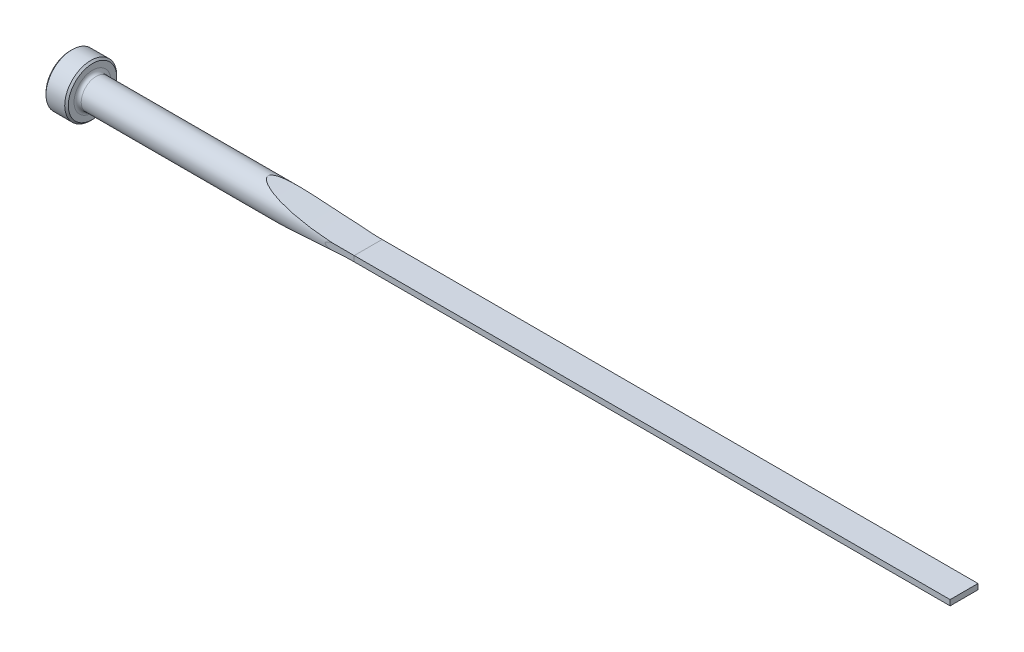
ISO-10303-21;
HEADER;
FILE_DESCRIPTION(('STEP AP214'),'2;1');
FILE_NAME('part.step','',(''),(''),'','','');
FILE_SCHEMA(('AUTOMOTIVE_DESIGN { 1 0 10303 214 1 1 1 1 }'));
ENDSEC;
DATA;
#1=APPLICATION_CONTEXT('core data for automotive mechanical design processes');
#2=APPLICATION_PROTOCOL_DEFINITION('international standard','automotive_design',2000,#1);
#3=PRODUCT_CONTEXT('',#1,'mechanical');
#4=PRODUCT('Part','Part','',(#3));
#5=PRODUCT_RELATED_PRODUCT_CATEGORY('part','',(#4));
#6=PRODUCT_DEFINITION_FORMATION('','',#4);
#7=PRODUCT_DEFINITION_CONTEXT('part definition',#1,'design');
#8=PRODUCT_DEFINITION('design','',#6,#7);
#9=PRODUCT_DEFINITION_SHAPE('','',#8);
#10=(LENGTH_UNIT() NAMED_UNIT(*) SI_UNIT(.MILLI.,.METRE.));
#11=(NAMED_UNIT(*) PLANE_ANGLE_UNIT() SI_UNIT($,.RADIAN.));
#12=(NAMED_UNIT(*) SI_UNIT($,.STERADIAN.) SOLID_ANGLE_UNIT());
#13=UNCERTAINTY_MEASURE_WITH_UNIT(LENGTH_MEASURE(1.E-05),#10,'distance_accuracy_value','');
#14=(GEOMETRIC_REPRESENTATION_CONTEXT(3) GLOBAL_UNCERTAINTY_ASSIGNED_CONTEXT((#13)) GLOBAL_UNIT_ASSIGNED_CONTEXT((#10,
#11,#12)) REPRESENTATION_CONTEXT('',''));
#15=CARTESIAN_POINT('',(0.,0.,0.));
#16=DIRECTION('',(0.,0.,1.));
#17=DIRECTION('',(1.,0.,0.));
#18=AXIS2_PLACEMENT_3D('',#15,#16,#17);
#19=CARTESIAN_POINT('',(0.,0.,0.));
#20=DIRECTION('',(-1.,0.,0.));
#21=DIRECTION('',(0.,0.,1.));
#22=AXIS2_PLACEMENT_3D('',#19,#20,#21);
#23=CYLINDRICAL_SURFACE('',#22,3.175);
#24=CARTESIAN_POINT('',(5.5118,0.,0.));
#25=DIRECTION('',(-1.,0.,0.));
#26=DIRECTION('',(0.,0.,1.));
#27=AXIS2_PLACEMENT_3D('',#24,#25,#26);
#28=CIRCLE('',#27,3.175);
#29=CARTESIAN_POINT('',(5.5118,0.,3.175));
#30=VERTEX_POINT('',#29);
#31=EDGE_CURVE('E153',#30,#30,#28,.F.);
#32=ORIENTED_EDGE('',*,*,#31,.T.);
#33=EDGE_LOOP('',(#32));
#34=FACE_BOUND('',#33,.T.);
#35=CARTESIAN_POINT('',(63.5,1.11760000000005,2.97179999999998));
#36=CARTESIAN_POINT('',(63.2357957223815,1.11753103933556,2.9717988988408));
#37=CARTESIAN_POINT('',(62.9715815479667,1.11446404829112,2.97297778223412));
#38=CARTESIAN_POINT('',(62.443191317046,1.10185346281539,2.97768913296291));
#39=CARTESIAN_POINT('',(62.1790153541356,1.09230645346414,2.98122284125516));
#40=CARTESIAN_POINT('',(61.6493837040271,1.06617269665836,2.9906669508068));
#41=CARTESIAN_POINT('',(61.3839303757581,1.04954219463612,2.99659211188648));
#42=CARTESIAN_POINT('',(60.8537877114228,1.00807205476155,3.01079697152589));
#43=CARTESIAN_POINT('',(60.5890982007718,0.983234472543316,3.01907608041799));
#44=CARTESIAN_POINT('',(60.0615789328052,0.92338352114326,3.03792875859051));
#45=CARTESIAN_POINT('',(59.7987461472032,0.888396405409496,3.04849639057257));
#46=CARTESIAN_POINT('',(59.4064659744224,0.825064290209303,3.06600005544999));
#47=CARTESIAN_POINT('',(59.2761087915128,0.802161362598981,3.07210597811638));
#48=CARTESIAN_POINT('',(59.0163554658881,0.751700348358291,3.08484243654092));
#49=CARTESIAN_POINT('',(58.8869590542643,0.724143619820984,3.09147281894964));
#50=CARTESIAN_POINT('',(58.6294078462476,0.662714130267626,3.10522998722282));
#51=CARTESIAN_POINT('',(58.5012554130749,0.628831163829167,3.11235756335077));
#52=CARTESIAN_POINT('',(58.3111286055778,0.570760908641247,3.12333709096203));
#53=CARTESIAN_POINT('',(58.2480498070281,0.550175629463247,3.12704828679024));
#54=CARTESIAN_POINT('',(58.1230456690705,0.505797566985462,3.13453462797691));
#55=CARTESIAN_POINT('',(58.061119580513,0.482006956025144,3.13830972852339));
#56=CARTESIAN_POINT('',(57.9388265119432,0.42976946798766,3.1458898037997));
#57=CARTESIAN_POINT('',(57.8784713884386,0.401294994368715,3.14969481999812));
#58=CARTESIAN_POINT('',(57.761395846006,0.337410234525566,3.1571914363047));
#59=CARTESIAN_POINT('',(57.7046630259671,0.302025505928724,3.16088339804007));
#60=CARTESIAN_POINT('',(57.6318457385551,0.243613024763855,3.16568281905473));
#61=CARTESIAN_POINT('',(57.6116878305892,0.225790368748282,3.16701915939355));
#62=CARTESIAN_POINT('',(57.5741240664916,0.187442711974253,3.16952077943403));
#63=CARTESIAN_POINT('',(57.5567070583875,0.166929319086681,3.17068675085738));
#64=CARTESIAN_POINT('',(57.5335834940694,0.132884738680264,3.17224001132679));
#65=CARTESIAN_POINT('',(57.5261886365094,0.120518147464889,3.17273788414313));
#66=CARTESIAN_POINT('',(57.5132601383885,0.0948283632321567,3.1736095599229));
#67=CARTESIAN_POINT('',(57.5077252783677,0.0815058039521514,3.17398344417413));
#68=CARTESIAN_POINT('',(57.4990082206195,0.053897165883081,3.1745727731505));
#69=CARTESIAN_POINT('',(57.4958567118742,0.0396010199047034,3.17478615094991));
#70=CARTESIAN_POINT('',(57.4924789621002,0.0106696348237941,3.17501485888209));
#71=CARTESIAN_POINT('',(57.4922487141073,-0.00396511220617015,3.17503046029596));
#72=CARTESIAN_POINT('',(57.4945596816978,-0.0309283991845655,3.17487397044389));
#73=CARTESIAN_POINT('',(57.4967167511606,-0.0432925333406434,3.17472789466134));
#74=CARTESIAN_POINT('',(57.5029656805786,-0.0675187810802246,3.17430516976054));
#75=CARTESIAN_POINT('',(57.5070594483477,-0.0793803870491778,3.17402839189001));
#76=CARTESIAN_POINT('',(57.5191372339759,-0.107852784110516,3.17321302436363));
#77=CARTESIAN_POINT('',(57.5280454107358,-0.124065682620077,3.17261252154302));
#78=CARTESIAN_POINT('',(57.5482326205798,-0.154926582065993,3.17125564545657));
#79=CARTESIAN_POINT('',(57.5595181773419,-0.169570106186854,3.1704988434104));
#80=CARTESIAN_POINT('',(57.5944341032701,-0.209900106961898,3.16816531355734));
#81=CARTESIAN_POINT('',(57.6200991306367,-0.233790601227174,3.16645919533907));
#82=CARTESIAN_POINT('',(57.6742928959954,-0.277993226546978,3.1628833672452));
#83=CARTESIAN_POINT('',(57.702830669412,-0.298293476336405,3.16101314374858));
#84=CARTESIAN_POINT('',(57.7823413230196,-0.349789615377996,3.155843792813));
#85=CARTESIAN_POINT('',(57.8348887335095,-0.37851929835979,3.15247078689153));
#86=CARTESIAN_POINT('',(57.9423072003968,-0.431320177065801,3.14567655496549));
#87=CARTESIAN_POINT('',(57.9971839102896,-0.455379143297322,3.14225522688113));
#88=CARTESIAN_POINT('',(58.1085705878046,-0.500302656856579,3.13541729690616));
#89=CARTESIAN_POINT('',(58.165087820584,-0.521149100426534,3.13200082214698));
#90=CARTESIAN_POINT('',(58.2788979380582,-0.560302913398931,3.12523191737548));
#91=CARTESIAN_POINT('',(58.3361896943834,-0.578613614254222,3.12187940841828));
#92=CARTESIAN_POINT('',(58.5297297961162,-0.636913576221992,3.1107447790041));
#93=CARTESIAN_POINT('',(58.6673130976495,-0.672489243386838,3.10314401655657));
#94=CARTESIAN_POINT('',(58.9441302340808,-0.736755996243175,3.0885058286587));
#95=CARTESIAN_POINT('',(59.0833651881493,-0.765442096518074,3.08146881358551));
#96=CARTESIAN_POINT('',(59.3631295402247,-0.817784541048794,3.06799404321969));
#97=CARTESIAN_POINT('',(59.5036611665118,-0.841429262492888,3.06155769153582));
#98=CARTESIAN_POINT('',(59.7853732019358,-0.884713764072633,3.04932851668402));
#99=CARTESIAN_POINT('',(59.9265536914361,-0.904353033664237,3.04353577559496));
#100=CARTESIAN_POINT('',(60.3506897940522,-0.95834898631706,3.02714982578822));
#101=CARTESIAN_POINT('',(60.6343099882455,-0.987796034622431,3.01754551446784));
#102=CARTESIAN_POINT('',(61.202086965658,-1.03680456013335,3.00105004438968));
#103=CARTESIAN_POINT('',(61.4862426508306,-1.05637822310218,2.99415554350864));
#104=CARTESIAN_POINT('',(61.9149168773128,-1.079629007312,2.98581493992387));
#105=CARTESIAN_POINT('',(62.059256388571,-1.08638681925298,2.98335806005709));
#106=CARTESIAN_POINT('',(62.3480641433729,-1.0978849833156,2.97914616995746));
#107=CARTESIAN_POINT('',(62.4925324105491,-1.1026248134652,2.97739134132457));
#108=CARTESIAN_POINT('',(62.780840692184,-1.1101534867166,2.97459254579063));
#109=CARTESIAN_POINT('',(62.9246804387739,-1.11295147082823,2.97354524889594));
#110=CARTESIAN_POINT('',(63.2123469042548,-1.11667170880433,2.97214903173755));
#111=CARTESIAN_POINT('',(63.3561736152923,-1.11759449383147,2.97179991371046));
#112=CARTESIAN_POINT('',(63.5,-1.11760000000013,2.97179999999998));
#113=B_SPLINE_CURVE_WITH_KNOTS('',3,(#35,#36,#37,#38,#39,#40,#41,#42,#43,#44,#45,#46,#47,#48,
#49,#50,#51,#52,#53,#54,#55,#56,#57,#58,#59,#60,#61,#62,#63,#64,#65,#66,#67,#68,#69,#70,#71,#72,
#73,#74,#75,#76,#77,#78,#79,#80,#81,#82,#83,#84,#85,#86,#87,#88,#89,#90,#91,#92,#93,#94,#95,#96,
#97,#98,#99,#100,#101,#102,#103,#104,#105,#106,#107,#108,#109,#110,#111,#112),.UNSPECIFIED.,.F.,
.F.,(4,2,2,2,2,2,2,2,2,2,2,2,2,2,2,2,2,2,2,2,2,2,2,2,2,2,2,2,2,2,2,2,2,2,2,2,2,2,4),(0.,
0.792608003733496,1.58563403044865,2.38363126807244,3.18142878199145,3.97718078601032,
4.37459807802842,4.77189959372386,5.16984765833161,5.36916585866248,5.56834964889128,
5.7687520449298,5.96842682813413,6.04909120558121,6.12941838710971,6.17255460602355,
6.21566248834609,6.25931641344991,6.30291045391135,6.34039079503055,6.37790813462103,
6.43311579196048,6.48847696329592,6.59320183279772,6.69826703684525,6.87774508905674,
7.05768691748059,7.23860836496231,7.41928981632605,7.84588397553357,8.2727859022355,
8.70066164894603,9.12859189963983,9.98423938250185,10.8388282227,11.2723701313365,
11.7060241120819,12.1376226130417,12.569098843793),.UNSPECIFIED.);
#114=CARTESIAN_POINT('',(58.8183920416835,0.707555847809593,3.09515584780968));
#115=VERTEX_POINT('',#114);
#116=CARTESIAN_POINT('',(58.8183920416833,-0.707555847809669,3.09515584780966));
#117=VERTEX_POINT('',#116);
#118=EDGE_CURVE('E156',#115,#117,#113,.T.);
#119=ORIENTED_EDGE('',*,*,#118,.F.);
#120=CARTESIAN_POINT('',(63.5,0.584199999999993,3.12079082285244));
#121=CARTESIAN_POINT('',(63.2371745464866,0.584199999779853,3.12078868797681));
#122=CARTESIAN_POINT('',(62.9743505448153,0.585365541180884,3.1205729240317));
#123=CARTESIAN_POINT('',(62.4487238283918,0.590027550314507,3.11969558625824));
#124=CARTESIAN_POINT('',(62.1859211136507,0.593524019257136,3.11903401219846));
#125=CARTESIAN_POINT('',(61.3972884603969,0.607514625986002,3.11635178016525));
#126=CARTESIAN_POINT('',(60.8715185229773,0.621509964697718,3.11363357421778));
#127=CARTESIAN_POINT('',(59.8126378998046,0.659101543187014,3.10589488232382));
#128=CARTESIAN_POINT('',(59.2795323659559,0.682835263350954,3.10084129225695));
#129=CARTESIAN_POINT('',(58.2141584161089,0.739880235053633,3.08772725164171));
#130=CARTESIAN_POINT('',(57.6818897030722,0.773186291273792,3.07966843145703));
#131=CARTESIAN_POINT('',(56.6145881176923,0.849617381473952,3.05946899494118));
#132=CARTESIAN_POINT('',(56.0795602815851,0.892805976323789,3.04730170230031));
#133=CARTESIAN_POINT('',(55.0105273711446,0.98885062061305,3.01750402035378));
#134=CARTESIAN_POINT('',(54.4765222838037,1.04170654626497,2.99987370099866));
#135=CARTESIAN_POINT('',(53.4083814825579,1.15720203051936,2.95724818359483));
#136=CARTESIAN_POINT('',(52.8742493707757,1.21986783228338,2.93223306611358));
#137=CARTESIAN_POINT('',(51.8078537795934,1.35479225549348,2.8723879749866));
#138=CARTESIAN_POINT('',(51.275589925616,1.42704882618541,2.83756009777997));
#139=CARTESIAN_POINT('',(50.2195468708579,1.58015660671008,2.75522233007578));
#140=CARTESIAN_POINT('',(49.6957406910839,1.66089887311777,2.70786361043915));
#141=CARTESIAN_POINT('',(48.9123277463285,1.78881840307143,2.62361042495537));
#142=CARTESIAN_POINT('',(48.6514552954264,1.83261396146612,2.59330680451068));
#143=CARTESIAN_POINT('',(48.130757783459,1.92241510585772,2.52746039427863));
#144=CARTESIAN_POINT('',(47.8709326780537,1.96842059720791,2.49191782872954));
#145=CARTESIAN_POINT('',(47.3538754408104,2.06234142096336,2.41475697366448));
#146=CARTESIAN_POINT('',(47.0966368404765,2.11024620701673,2.37316953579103));
#147=CARTESIAN_POINT('',(46.583893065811,2.20806672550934,2.28243713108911));
#148=CARTESIAN_POINT('',(46.3283877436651,2.25798228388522,2.23329281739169));
#149=CARTESIAN_POINT('',(45.8200571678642,2.3595957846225,2.12566034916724));
#150=CARTESIAN_POINT('',(45.5672286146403,2.41129108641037,2.06718560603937));
#151=CARTESIAN_POINT('',(45.1906253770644,2.48998603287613,1.97035684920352));
#152=CARTESIAN_POINT('',(45.0655521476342,2.5164050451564,1.93656774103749));
#153=CARTESIAN_POINT('',(44.8164899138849,2.56957146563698,1.86545052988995));
#154=CARTESIAN_POINT('',(44.6925008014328,2.59631884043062,1.82812278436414));
#155=CARTESIAN_POINT('',(44.5043779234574,2.63731895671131,1.76799333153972));
#156=CARTESIAN_POINT('',(44.4397421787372,2.65148196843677,1.74669729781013));
#157=CARTESIAN_POINT('',(44.3109121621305,2.67986105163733,1.70283623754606));
#158=CARTESIAN_POINT('',(44.2467179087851,2.69407712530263,1.68027115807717));
#159=CARTESIAN_POINT('',(44.054818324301,2.73679613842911,1.61045418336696));
#160=CARTESIAN_POINT('',(43.9278729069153,2.76535313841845,1.56110473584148));
#161=CARTESIAN_POINT('',(43.6766959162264,2.82242510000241,1.45538898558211));
#162=CARTESIAN_POINT('',(43.5524682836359,2.85093995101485,1.39901319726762));
#163=CARTESIAN_POINT('',(43.3083876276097,2.90750331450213,1.27733339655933));
#164=CARTESIAN_POINT('',(43.1885301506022,2.93555228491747,1.21203881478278));
#165=CARTESIAN_POINT('',(43.0134198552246,2.97689561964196,1.10462346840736));
#166=CARTESIAN_POINT('',(42.9555167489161,2.99063021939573,1.06700049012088));
#167=CARTESIAN_POINT('',(42.8421800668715,3.01762925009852,0.988070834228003));
#168=CARTESIAN_POINT('',(42.7867451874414,3.03089392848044,0.946766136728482));
#169=CARTESIAN_POINT('',(42.6795671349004,3.05664308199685,0.859997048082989));
#170=CARTESIAN_POINT('',(42.6278038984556,3.06913174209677,0.814558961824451));
#171=CARTESIAN_POINT('',(42.5291143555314,3.09302846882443,0.718503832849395));
#172=CARTESIAN_POINT('',(42.4821794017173,3.10443846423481,0.66789638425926));
#173=CARTESIAN_POINT('',(42.4062402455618,3.12295621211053,0.573975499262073));
#174=CARTESIAN_POINT('',(42.3756865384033,3.13042646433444,0.532000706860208));
#175=CARTESIAN_POINT('',(42.319989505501,3.14407041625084,0.444313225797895));
#176=CARTESIAN_POINT('',(42.2948479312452,3.15024369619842,0.398599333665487));
#177=CARTESIAN_POINT('',(42.2515870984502,3.16088069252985,0.302976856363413));
#178=CARTESIAN_POINT('',(42.2335600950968,3.16532194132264,0.253022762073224));
#179=CARTESIAN_POINT('',(42.2071060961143,3.1718436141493,0.150502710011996));
#180=CARTESIAN_POINT('',(42.1986583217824,3.17392914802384,0.09794266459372));
#181=CARTESIAN_POINT('',(42.1928749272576,3.17535672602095,-0.0025704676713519));
#182=CARTESIAN_POINT('',(42.1945169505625,3.17495118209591,-0.050461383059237));
#183=CARTESIAN_POINT('',(42.206329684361,3.17203608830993,-0.145121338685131));
#184=CARTESIAN_POINT('',(42.2165083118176,3.16952458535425,-0.191889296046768));
#185=CARTESIAN_POINT('',(42.2467484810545,3.16207319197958,-0.291266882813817));
#186=CARTESIAN_POINT('',(42.2682680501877,3.15677538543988,-0.343396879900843));
#187=CARTESIAN_POINT('',(42.319104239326,3.1442883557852,-0.44342951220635));
#188=CARTESIAN_POINT('',(42.3484358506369,3.13709549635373,-0.491323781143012));
#189=CARTESIAN_POINT('',(42.4341809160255,3.11612565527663,-0.613534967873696));
#190=CARTESIAN_POINT('',(42.4955856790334,3.10116282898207,-0.68409687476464));
#191=CARTESIAN_POINT('',(42.6274278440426,3.06921055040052,-0.81556719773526));
#192=CARTESIAN_POINT('',(42.6978914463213,3.05221523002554,-0.876446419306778));
#193=CARTESIAN_POINT('',(42.8740641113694,3.0099730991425,-1.01378453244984));
#194=CARTESIAN_POINT('',(42.9824809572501,2.98417432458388,-1.08655383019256));
#195=CARTESIAN_POINT('',(43.2056195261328,2.93154913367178,-1.22141406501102));
#196=CARTESIAN_POINT('',(43.3203543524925,2.9047206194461,-1.28348161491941));
#197=CARTESIAN_POINT('',(43.5543659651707,2.8505103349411,-1.39976579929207));
#198=CARTESIAN_POINT('',(43.6736638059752,2.82312636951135,-1.45393855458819));
#199=CARTESIAN_POINT('',(43.9148065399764,2.76831054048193,-1.55576795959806));
#200=CARTESIAN_POINT('',(44.0366486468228,2.74087875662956,-1.60343134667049));
#201=CARTESIAN_POINT('',(44.2724756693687,2.6883146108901,-1.68995257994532));
#202=CARTESIAN_POINT('',(44.3863134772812,2.66317312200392,-1.72920940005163));
#203=CARTESIAN_POINT('',(44.6152532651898,2.61308810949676,-1.80399982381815));
#204=CARTESIAN_POINT('',(44.7303553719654,2.5881446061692,-1.83953305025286));
#205=CARTESIAN_POINT('',(45.07725239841,2.51369761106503,-1.94140787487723));
#206=CARTESIAN_POINT('',(45.3105347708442,2.46460067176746,-2.00298800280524));
#207=CARTESIAN_POINT('',(45.7801839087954,2.36775045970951,-2.11658508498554));
#208=CARTESIAN_POINT('',(46.016556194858,2.32000027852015,-2.16858134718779));
#209=CARTESIAN_POINT('',(46.4912089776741,2.2261369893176,-2.26482997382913));
#210=CARTESIAN_POINT('',(46.7294896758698,2.18002405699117,-2.30908150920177));
#211=CARTESIAN_POINT('',(47.2077596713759,2.08950783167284,-2.39130118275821));
#212=CARTESIAN_POINT('',(47.4477507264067,2.04510673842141,-2.42926143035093));
#213=CARTESIAN_POINT('',(47.9288506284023,1.95815199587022,-2.49987840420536));
#214=CARTESIAN_POINT('',(48.1699595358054,1.91559844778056,-2.5325348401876));
#215=CARTESIAN_POINT('',(48.8939707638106,1.79090778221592,-2.62372500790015));
#216=CARTESIAN_POINT('',(49.3782070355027,1.71161765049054,-2.67558617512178));
#217=CARTESIAN_POINT('',(50.4017474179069,1.5527357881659,-2.77111730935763));
#218=CARTESIAN_POINT('',(50.9413255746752,1.47404484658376,-2.81328790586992));
#219=CARTESIAN_POINT('',(52.0226566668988,1.32650947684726,-2.88578179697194));
#220=CARTESIAN_POINT('',(52.5644098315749,1.25766611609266,-2.91610380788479));
#221=CARTESIAN_POINT('',(53.6499230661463,1.12988542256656,-2.96795071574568));
#222=CARTESIAN_POINT('',(54.1936843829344,1.07095595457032,-2.98946864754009));
#223=CARTESIAN_POINT('',(55.2823907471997,0.963128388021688,-3.02592833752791));
#224=CARTESIAN_POINT('',(55.8273357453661,0.91422987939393,-3.0408703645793));
#225=CARTESIAN_POINT('',(56.9170263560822,0.826585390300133,-3.06585234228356));
#226=CARTESIAN_POINT('',(57.4617700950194,0.787818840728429,-3.07590226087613));
#227=CARTESIAN_POINT('',(58.5519411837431,0.720327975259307,-3.09240327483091));
#228=CARTESIAN_POINT('',(59.0973685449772,0.691603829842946,-3.09885430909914));
#229=CARTESIAN_POINT('',(60.1884833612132,0.644220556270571,-3.10904978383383));
#230=CARTESIAN_POINT('',(60.7341706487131,0.625557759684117,-3.11279521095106));
#231=CARTESIAN_POINT('',(61.8257926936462,0.598289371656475,-3.11815160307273));
#232=CARTESIAN_POINT('',(62.3717274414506,0.5896834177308,-3.11976264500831));
#233=CARTESIAN_POINT('',(63.0147373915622,0.585471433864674,-3.12055240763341));
#234=CARTESIAN_POINT('',(63.1117904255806,0.58499464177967,-3.12064189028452));
#235=CARTESIAN_POINT('',(63.3058955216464,0.584358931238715,-3.12076117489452));
#236=CARTESIAN_POINT('',(63.402947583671,0.584200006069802,-3.12079097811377));
#237=CARTESIAN_POINT('',(63.5,0.584199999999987,-3.12079082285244));
#238=B_SPLINE_CURVE_WITH_KNOTS('',3,(#120,#121,#122,#123,#124,#125,#126,#127,#128,#129,#130,
#131,#132,#133,#134,#135,#136,#137,#138,#139,#140,#141,#142,#143,#144,#145,#146,#147,#148,#149,
#150,#151,#152,#153,#154,#155,#156,#157,#158,#159,#160,#161,#162,#163,#164,#165,#166,#167,#168,
#169,#170,#171,#172,#173,#174,#175,#176,#177,#178,#179,#180,#181,#182,#183,#184,#185,#186,#187,
#188,#189,#190,#191,#192,#193,#194,#195,#196,#197,#198,#199,#200,#201,#202,#203,#204,#205,#206,
#207,#208,#209,#210,#211,#212,#213,#214,#215,#216,#217,#218,#219,#220,#221,#222,#223,#224,#225,
#226,#227,#228,#229,#230,#231,#232,#233,#234,#235,#236,#237),.UNSPECIFIED.,.F.,.F.,(4,2,2,2,2,2,
2,2,2,2,2,2,2,2,2,2,2,2,2,2,2,2,2,2,2,2,2,2,2,2,2,2,2,2,2,2,2,2,2,2,2,2,2,2,2,2,2,2,2,2,2,2,2,2,
2,2,2,2,4),(0.,0.788470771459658,1.5769419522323,3.15473771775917,4.75561916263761,
6.35563337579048,7.96624289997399,9.57683180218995,11.1918053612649,12.8064341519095,
14.4024082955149,15.2011185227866,15.9997945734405,16.7945288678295,17.5891945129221,
18.3827280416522,18.7793586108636,19.1759491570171,19.38447279,19.5930051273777,
20.0103161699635,20.4281968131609,20.8456389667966,21.056749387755,21.267746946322,
21.4774848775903,21.686840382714,21.8438665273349,22.0009434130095,22.1599950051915,
22.3187009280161,22.4616100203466,22.6046517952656,22.7736460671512,22.942967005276,
23.2255463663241,23.5089622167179,23.9072760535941,24.3064496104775,24.7077634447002,
25.108658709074,25.4776243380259,25.8466273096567,26.5849685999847,27.3248857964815,
28.064882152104,28.8057997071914,29.5467577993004,31.0266670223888,32.6671542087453,
34.3078190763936,35.9497794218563,37.5916726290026,39.2302062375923,40.8687676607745,
42.5067312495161,44.1446357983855,44.4357983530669,44.7269547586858),.UNSPECIFIED.);
#239=CARTESIAN_POINT('',(58.8183920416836,0.707555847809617,-3.09515584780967));
#240=VERTEX_POINT('',#239);
#241=EDGE_CURVE('E106',#115,#240,#238,.T.);
#242=ORIENTED_EDGE('',*,*,#241,.T.);
#243=CARTESIAN_POINT('',(63.5,1.11760000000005,-2.97179999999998));
#244=CARTESIAN_POINT('',(63.2357957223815,1.11753103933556,-2.9717988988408));
#245=CARTESIAN_POINT('',(62.9715815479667,1.11446404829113,-2.97297778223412));
#246=CARTESIAN_POINT('',(62.443191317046,1.10185346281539,-2.97768913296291));
#247=CARTESIAN_POINT('',(62.1790153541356,1.09230645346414,-2.98122284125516));
#248=CARTESIAN_POINT('',(61.6493837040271,1.06617269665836,-2.9906669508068));
#249=CARTESIAN_POINT('',(61.383930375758,1.04954219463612,-2.99659211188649));
#250=CARTESIAN_POINT('',(60.8537877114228,1.00807205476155,-3.01079697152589));
#251=CARTESIAN_POINT('',(60.5890982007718,0.983234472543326,-3.01907608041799));
#252=CARTESIAN_POINT('',(60.0615789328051,0.923383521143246,-3.03792875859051));
#253=CARTESIAN_POINT('',(59.7987461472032,0.888396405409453,-3.04849639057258));
#254=CARTESIAN_POINT('',(59.4064659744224,0.825064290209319,-3.06600005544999));
#255=CARTESIAN_POINT('',(59.2761087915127,0.802161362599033,-3.07210597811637));
#256=CARTESIAN_POINT('',(59.016355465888,0.751700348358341,-3.08484243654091));
#257=CARTESIAN_POINT('',(58.8869590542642,0.724143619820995,-3.09147281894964));
#258=CARTESIAN_POINT('',(58.6294078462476,0.662714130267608,-3.10522998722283));
#259=CARTESIAN_POINT('',(58.5012554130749,0.628831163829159,-3.11235756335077));
#260=CARTESIAN_POINT('',(58.3111286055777,0.57076090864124,-3.12333709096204));
#261=CARTESIAN_POINT('',(58.2480498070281,0.550175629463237,-3.12704828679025));
#262=CARTESIAN_POINT('',(58.1230456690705,0.505797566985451,-3.13453462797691));
#263=CARTESIAN_POINT('',(58.061119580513,0.482006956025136,-3.13830972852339));
#264=CARTESIAN_POINT('',(57.9388265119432,0.429769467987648,-3.14588980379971));
#265=CARTESIAN_POINT('',(57.8784713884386,0.401294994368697,-3.14969481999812));
#266=CARTESIAN_POINT('',(57.761395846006,0.337410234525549,-3.1571914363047));
#267=CARTESIAN_POINT('',(57.7046630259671,0.302025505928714,-3.16088339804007));
#268=CARTESIAN_POINT('',(57.6318457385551,0.243613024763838,-3.16568281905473));
#269=CARTESIAN_POINT('',(57.6116878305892,0.225790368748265,-3.16701915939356));
#270=CARTESIAN_POINT('',(57.5741240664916,0.187442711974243,-3.16952077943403));
#271=CARTESIAN_POINT('',(57.5567070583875,0.166929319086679,-3.17068675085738));
#272=CARTESIAN_POINT('',(57.5335834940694,0.132884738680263,-3.17224001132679));
#273=CARTESIAN_POINT('',(57.5261886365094,0.120518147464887,-3.17273788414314));
#274=CARTESIAN_POINT('',(57.5132601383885,0.0948283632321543,-3.1736095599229));
#275=CARTESIAN_POINT('',(57.5077252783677,0.0815058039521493,-3.17398344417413));
#276=CARTESIAN_POINT('',(57.4990082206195,0.0538971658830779,-3.1745727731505));
#277=CARTESIAN_POINT('',(57.4958567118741,0.0396010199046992,-3.17478615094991));
#278=CARTESIAN_POINT('',(57.4924789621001,0.0106696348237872,-3.17501485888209));
#279=CARTESIAN_POINT('',(57.4922487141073,-0.00396511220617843,-3.17503046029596));
#280=CARTESIAN_POINT('',(57.4945596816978,-0.0309283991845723,-3.17487397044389));
#281=CARTESIAN_POINT('',(57.4967167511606,-0.0432925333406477,-3.17472789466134));
#282=CARTESIAN_POINT('',(57.5029656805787,-0.0675187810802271,-3.17430516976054));
#283=CARTESIAN_POINT('',(57.5070594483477,-0.0793803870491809,-3.17402839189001));
#284=CARTESIAN_POINT('',(57.5191372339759,-0.107852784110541,-3.17321302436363));
#285=CARTESIAN_POINT('',(57.5280454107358,-0.124065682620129,-3.17261252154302));
#286=CARTESIAN_POINT('',(57.5482326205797,-0.154926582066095,-3.17125564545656));
#287=CARTESIAN_POINT('',(57.5595181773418,-0.16957010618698,-3.17049884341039));
#288=CARTESIAN_POINT('',(57.59443410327,-0.209900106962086,-3.16816531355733));
#289=CARTESIAN_POINT('',(57.6200991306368,-0.233790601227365,-3.16645919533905));
#290=CARTESIAN_POINT('',(57.6742928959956,-0.277993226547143,-3.16288336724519));
#291=CARTESIAN_POINT('',(57.7028306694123,-0.298293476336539,-3.16101314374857));
#292=CARTESIAN_POINT('',(57.7823413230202,-0.349789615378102,-3.15584379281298));
#293=CARTESIAN_POINT('',(57.8348887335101,-0.378519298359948,-3.15247078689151));
#294=CARTESIAN_POINT('',(57.9423072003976,-0.431320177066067,-3.14567655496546));
#295=CARTESIAN_POINT('',(57.9971839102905,-0.455379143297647,-3.14225522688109));
#296=CARTESIAN_POINT('',(58.1085705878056,-0.500302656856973,-3.13541729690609));
#297=CARTESIAN_POINT('',(58.1650878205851,-0.52114910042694,-3.13200082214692));
#298=CARTESIAN_POINT('',(58.2788979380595,-0.56030291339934,-3.12523191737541));
#299=CARTESIAN_POINT('',(58.3361896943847,-0.578613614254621,-3.12187940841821));
#300=CARTESIAN_POINT('',(58.5297297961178,-0.636913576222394,-3.11074477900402));
#301=CARTESIAN_POINT('',(58.6673130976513,-0.672489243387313,-3.10314401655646));
#302=CARTESIAN_POINT('',(58.9441302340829,-0.736755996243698,-3.08850582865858));
#303=CARTESIAN_POINT('',(59.0833651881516,-0.76544209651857,-3.08146881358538));
#304=CARTESIAN_POINT('',(59.3631295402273,-0.81778454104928,-3.06799404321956));
#305=CARTESIAN_POINT('',(59.5036611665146,-0.84142926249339,-3.06155769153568));
#306=CARTESIAN_POINT('',(59.7853732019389,-0.884713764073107,-3.04932851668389));
#307=CARTESIAN_POINT('',(59.9265536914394,-0.904353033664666,-3.04353577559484));
#308=CARTESIAN_POINT('',(60.3506897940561,-0.95834898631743,-3.0271498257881));
#309=CARTESIAN_POINT('',(60.6343099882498,-0.987796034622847,-3.0175455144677));
#310=CARTESIAN_POINT('',(61.2020869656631,-1.0368045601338,-3.00105004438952));
#311=CARTESIAN_POINT('',(61.4862426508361,-1.05637822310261,-2.99415554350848));
#312=CARTESIAN_POINT('',(61.9149168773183,-1.0796290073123,-2.98581493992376));
#313=CARTESIAN_POINT('',(62.059256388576,-1.0863868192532,-2.98335806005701));
#314=CARTESIAN_POINT('',(62.348064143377,-1.09788498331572,-2.97914616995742));
#315=CARTESIAN_POINT('',(62.4925324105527,-1.10262481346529,-2.97739134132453));
#316=CARTESIAN_POINT('',(62.7808406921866,-1.11015348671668,-2.9745925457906));
#317=CARTESIAN_POINT('',(62.924680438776,-1.11295147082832,-2.97354524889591));
#318=CARTESIAN_POINT('',(63.2123469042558,-1.11667170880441,-2.97214903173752));
#319=CARTESIAN_POINT('',(63.3561736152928,-1.11759449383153,-2.97179991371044));
#320=CARTESIAN_POINT('',(63.5,-1.11760000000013,-2.97179999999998));
#321=B_SPLINE_CURVE_WITH_KNOTS('',3,(#243,#244,#245,#246,#247,#248,#249,#250,#251,#252,#253,
#254,#255,#256,#257,#258,#259,#260,#261,#262,#263,#264,#265,#266,#267,#268,#269,#270,#271,#272,
#273,#274,#275,#276,#277,#278,#279,#280,#281,#282,#283,#284,#285,#286,#287,#288,#289,#290,#291,
#292,#293,#294,#295,#296,#297,#298,#299,#300,#301,#302,#303,#304,#305,#306,#307,#308,#309,#310,
#311,#312,#313,#314,#315,#316,#317,#318,#319,#320),.UNSPECIFIED.,.F.,.F.,(4,2,2,2,2,2,2,2,2,2,2,
2,2,2,2,2,2,2,2,2,2,2,2,2,2,2,2,2,2,2,2,2,2,2,2,2,2,2,4),(0.,0.792608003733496,1.58563403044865,
2.38363126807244,3.18142878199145,3.97718078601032,4.37459807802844,4.77189959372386,
5.16984765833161,5.36916585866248,5.56834964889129,5.7687520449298,5.96842682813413,
6.04909120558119,6.12941838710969,6.17255460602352,6.21566248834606,6.25931641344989,
6.30291045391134,6.34039079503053,6.37790813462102,6.43311579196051,6.48847696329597,
6.59320183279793,6.69826703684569,6.87774508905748,7.05768691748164,7.23860836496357,
7.41928981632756,7.84588397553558,8.27278590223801,8.70066164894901,9.12859189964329,
9.98423938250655,10.838828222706,11.272370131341,11.706024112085,12.1376226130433,
12.569098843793),.UNSPECIFIED.);
#322=CARTESIAN_POINT('',(58.8183920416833,-0.707555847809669,-3.09515584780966));
#323=VERTEX_POINT('',#322);
#324=EDGE_CURVE('E175',#240,#323,#321,.T.);
#325=ORIENTED_EDGE('',*,*,#324,.T.);
#326=CARTESIAN_POINT('',(63.5,-0.584199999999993,3.12079082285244));
#327=CARTESIAN_POINT('',(63.2371745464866,-0.584199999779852,3.12078868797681));
#328=CARTESIAN_POINT('',(62.9743505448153,-0.585365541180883,3.1205729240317));
#329=CARTESIAN_POINT('',(62.4487238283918,-0.590027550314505,3.11969558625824));
#330=CARTESIAN_POINT('',(62.1859211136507,-0.593524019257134,3.11903401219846));
#331=CARTESIAN_POINT('',(61.3972884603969,-0.607514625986,3.11635178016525));
#332=CARTESIAN_POINT('',(60.8715185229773,-0.621509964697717,3.11363357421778));
#333=CARTESIAN_POINT('',(59.8126378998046,-0.659101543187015,3.10589488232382));
#334=CARTESIAN_POINT('',(59.279532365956,-0.682835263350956,3.10084129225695));
#335=CARTESIAN_POINT('',(58.214158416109,-0.739880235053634,3.08772725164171));
#336=CARTESIAN_POINT('',(57.6818897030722,-0.773186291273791,3.07966843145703));
#337=CARTESIAN_POINT('',(56.6145881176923,-0.849617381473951,3.05946899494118));
#338=CARTESIAN_POINT('',(56.0795602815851,-0.89280597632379,3.04730170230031));
#339=CARTESIAN_POINT('',(55.0105273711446,-0.988850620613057,3.01750402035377));
#340=CARTESIAN_POINT('',(54.4765222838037,-1.04170654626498,2.99987370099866));
#341=CARTESIAN_POINT('',(53.408381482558,-1.15720203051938,2.95724818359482));
#342=CARTESIAN_POINT('',(52.8742493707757,-1.2198678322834,2.93223306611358));
#343=CARTESIAN_POINT('',(51.8078537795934,-1.35479225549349,2.8723879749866));
#344=CARTESIAN_POINT('',(51.2755899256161,-1.42704882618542,2.83756009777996));
#345=CARTESIAN_POINT('',(50.219546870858,-1.58015660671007,2.75522233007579));
#346=CARTESIAN_POINT('',(49.695740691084,-1.66089887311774,2.70786361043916));
#347=CARTESIAN_POINT('',(48.9123277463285,-1.78881840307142,2.62361042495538));
#348=CARTESIAN_POINT('',(48.6514552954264,-1.83261396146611,2.59330680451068));
#349=CARTESIAN_POINT('',(48.130757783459,-1.92241510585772,2.52746039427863));
#350=CARTESIAN_POINT('',(47.8709326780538,-1.96842059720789,2.49191782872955));
#351=CARTESIAN_POINT('',(47.3538754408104,-2.06234142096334,2.41475697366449));
#352=CARTESIAN_POINT('',(47.0966368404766,-2.11024620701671,2.37316953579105));
#353=CARTESIAN_POINT('',(46.583893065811,-2.20806672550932,2.28243713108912));
#354=CARTESIAN_POINT('',(46.3283877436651,-2.25798228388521,2.23329281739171));
#355=CARTESIAN_POINT('',(45.8200571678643,-2.3595957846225,2.12566034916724));
#356=CARTESIAN_POINT('',(45.5672286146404,-2.41129108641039,2.06718560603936));
#357=CARTESIAN_POINT('',(45.1906253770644,-2.48998603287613,1.97035684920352));
#358=CARTESIAN_POINT('',(45.0655521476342,-2.51640504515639,1.9365677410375));
#359=CARTESIAN_POINT('',(44.816489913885,-2.56957146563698,1.86545052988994));
#360=CARTESIAN_POINT('',(44.6925008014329,-2.59631884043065,1.8281227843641));
#361=CARTESIAN_POINT('',(44.5043779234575,-2.63731895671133,1.76799333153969));
#362=CARTESIAN_POINT('',(44.4397421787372,-2.65148196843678,1.74669729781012));
#363=CARTESIAN_POINT('',(44.3109121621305,-2.67986105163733,1.70283623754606));
#364=CARTESIAN_POINT('',(44.2467179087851,-2.69407712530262,1.68027115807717));
#365=CARTESIAN_POINT('',(44.054818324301,-2.7367961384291,1.61045418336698));
#366=CARTESIAN_POINT('',(43.9278729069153,-2.76535313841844,1.56110473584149));
#367=CARTESIAN_POINT('',(43.6766959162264,-2.82242510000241,1.45538898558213));
#368=CARTESIAN_POINT('',(43.552468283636,-2.85093995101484,1.39901319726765));
#369=CARTESIAN_POINT('',(43.3083876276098,-2.90750331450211,1.27733339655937));
#370=CARTESIAN_POINT('',(43.1885301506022,-2.93555228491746,1.21203881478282));
#371=CARTESIAN_POINT('',(43.0134198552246,-2.97689561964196,1.10462346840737));
#372=CARTESIAN_POINT('',(42.9555167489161,-2.99063021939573,1.06700049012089));
#373=CARTESIAN_POINT('',(42.8421800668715,-3.01762925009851,0.988070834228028));
#374=CARTESIAN_POINT('',(42.7867451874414,-3.03089392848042,0.946766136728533));
#375=CARTESIAN_POINT('',(42.6795671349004,-3.05664308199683,0.859997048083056));
#376=CARTESIAN_POINT('',(42.6278038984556,-3.06913174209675,0.814558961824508));
#377=CARTESIAN_POINT('',(42.5291143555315,-3.09302846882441,0.718503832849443));
#378=CARTESIAN_POINT('',(42.4821794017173,-3.1044384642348,0.667896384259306));
#379=CARTESIAN_POINT('',(42.4062402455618,-3.12295621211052,0.573975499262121));
#380=CARTESIAN_POINT('',(42.3756865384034,-3.13042646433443,0.532000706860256));
#381=CARTESIAN_POINT('',(42.319989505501,-3.14407041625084,0.444313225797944));
#382=CARTESIAN_POINT('',(42.2948479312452,-3.15024369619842,0.398599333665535));
#383=CARTESIAN_POINT('',(42.2515870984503,-3.16088069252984,0.302976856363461));
#384=CARTESIAN_POINT('',(42.2335600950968,-3.16532194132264,0.253022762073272));
#385=CARTESIAN_POINT('',(42.2071060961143,-3.1718436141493,0.150502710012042));
#386=CARTESIAN_POINT('',(42.1986583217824,-3.17392914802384,0.0979426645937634));
#387=CARTESIAN_POINT('',(42.1928749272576,-3.17535672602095,-0.00257046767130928));
#388=CARTESIAN_POINT('',(42.1945169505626,-3.17495118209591,-0.0504613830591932));
#389=CARTESIAN_POINT('',(42.206329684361,-3.17203608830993,-0.145121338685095));
#390=CARTESIAN_POINT('',(42.2165083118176,-3.16952458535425,-0.191889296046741));
#391=CARTESIAN_POINT('',(42.2467484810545,-3.16207319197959,-0.291266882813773));
#392=CARTESIAN_POINT('',(42.2682680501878,-3.15677538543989,-0.343396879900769));
#393=CARTESIAN_POINT('',(42.319104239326,-3.14428835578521,-0.443429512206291));
#394=CARTESIAN_POINT('',(42.3484358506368,-3.13709549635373,-0.491323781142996));
#395=CARTESIAN_POINT('',(42.4341809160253,-3.11612565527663,-0.613534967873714));
#396=CARTESIAN_POINT('',(42.4955856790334,-3.10116282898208,-0.68409687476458));
#397=CARTESIAN_POINT('',(42.6274278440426,-3.06921055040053,-0.815567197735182));
#398=CARTESIAN_POINT('',(42.6978914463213,-3.05221523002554,-0.876446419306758));
#399=CARTESIAN_POINT('',(42.8740641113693,-3.00997309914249,-1.01378453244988));
#400=CARTESIAN_POINT('',(42.9824809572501,-2.98417432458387,-1.08655383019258));
#401=CARTESIAN_POINT('',(43.2056195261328,-2.93154913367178,-1.22141406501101));
#402=CARTESIAN_POINT('',(43.3203543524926,-2.9047206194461,-1.28348161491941));
#403=CARTESIAN_POINT('',(43.5543659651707,-2.8505103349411,-1.39976579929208));
#404=CARTESIAN_POINT('',(43.6736638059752,-2.82312636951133,-1.45393855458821));
#405=CARTESIAN_POINT('',(43.9148065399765,-2.76831054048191,-1.55576795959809));
#406=CARTESIAN_POINT('',(44.0366486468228,-2.74087875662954,-1.60343134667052));
#407=CARTESIAN_POINT('',(44.2724756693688,-2.68831461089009,-1.68995257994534));
#408=CARTESIAN_POINT('',(44.3863134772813,-2.66317312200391,-1.72920940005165));
#409=CARTESIAN_POINT('',(44.6152532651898,-2.61308810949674,-1.80399982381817));
#410=CARTESIAN_POINT('',(44.7303553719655,-2.58814460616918,-1.83953305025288));
#411=CARTESIAN_POINT('',(45.07725239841,-2.513697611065,-1.94140787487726));
#412=CARTESIAN_POINT('',(45.3105347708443,-2.46460067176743,-2.00298800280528));
#413=CARTESIAN_POINT('',(45.7801839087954,-2.36775045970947,-2.11658508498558));
#414=CARTESIAN_POINT('',(46.0165561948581,-2.32000027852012,-2.16858134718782));
#415=CARTESIAN_POINT('',(46.4912089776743,-2.22613698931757,-2.26482997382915));
#416=CARTESIAN_POINT('',(46.7294896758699,-2.18002405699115,-2.30908150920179));
#417=CARTESIAN_POINT('',(47.2077596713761,-2.0895078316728,-2.39130118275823));
#418=CARTESIAN_POINT('',(47.4477507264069,-2.04510673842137,-2.42926143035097));
#419=CARTESIAN_POINT('',(47.9288506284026,-1.95815199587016,-2.49987840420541));
#420=CARTESIAN_POINT('',(48.1699595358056,-1.9155984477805,-2.53253484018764));
#421=CARTESIAN_POINT('',(48.8939707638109,-1.79090778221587,-2.62372500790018));
#422=CARTESIAN_POINT('',(49.3782070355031,-1.71161765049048,-2.67558617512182));
#423=CARTESIAN_POINT('',(50.4017474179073,-1.55273578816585,-2.77111730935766));
#424=CARTESIAN_POINT('',(50.9413255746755,-1.47404484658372,-2.81328790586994));
#425=CARTESIAN_POINT('',(52.0226566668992,-1.32650947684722,-2.88578179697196));
#426=CARTESIAN_POINT('',(52.5644098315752,-1.25766611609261,-2.91610380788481));
#427=CARTESIAN_POINT('',(53.6499230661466,-1.12988542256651,-2.9679507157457));
#428=CARTESIAN_POINT('',(54.1936843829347,-1.07095595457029,-2.9894686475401));
#429=CARTESIAN_POINT('',(55.2823907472,-0.963128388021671,-3.02592833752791));
#430=CARTESIAN_POINT('',(55.8273357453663,-0.914229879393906,-3.04087036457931));
#431=CARTESIAN_POINT('',(56.9170263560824,-0.826585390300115,-3.06585234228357));
#432=CARTESIAN_POINT('',(57.4617700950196,-0.787818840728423,-3.07590226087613));
#433=CARTESIAN_POINT('',(58.5519411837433,-0.720327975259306,-3.09240327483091));
#434=CARTESIAN_POINT('',(59.0973685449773,-0.691603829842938,-3.09885430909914));
#435=CARTESIAN_POINT('',(60.1884833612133,-0.64422055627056,-3.10904978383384));
#436=CARTESIAN_POINT('',(60.7341706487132,-0.625557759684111,-3.11279521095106));
#437=CARTESIAN_POINT('',(61.8257926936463,-0.598289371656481,-3.11815160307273));
#438=CARTESIAN_POINT('',(62.3717274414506,-0.589683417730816,-3.11976264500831));
#439=CARTESIAN_POINT('',(63.0147373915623,-0.585471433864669,-3.12055240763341));
#440=CARTESIAN_POINT('',(63.1117904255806,-0.584994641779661,-3.12064189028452));
#441=CARTESIAN_POINT('',(63.3058955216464,-0.584358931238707,-3.12076117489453));
#442=CARTESIAN_POINT('',(63.4029475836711,-0.584200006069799,-3.12079097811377));
#443=CARTESIAN_POINT('',(63.5,-0.5842,-3.12079082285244));
#444=B_SPLINE_CURVE_WITH_KNOTS('',3,(#326,#327,#328,#329,#330,#331,#332,#333,#334,#335,#336,
#337,#338,#339,#340,#341,#342,#343,#344,#345,#346,#347,#348,#349,#350,#351,#352,#353,#354,#355,
#356,#357,#358,#359,#360,#361,#362,#363,#364,#365,#366,#367,#368,#369,#370,#371,#372,#373,#374,
#375,#376,#377,#378,#379,#380,#381,#382,#383,#384,#385,#386,#387,#388,#389,#390,#391,#392,#393,
#394,#395,#396,#397,#398,#399,#400,#401,#402,#403,#404,#405,#406,#407,#408,#409,#410,#411,#412,
#413,#414,#415,#416,#417,#418,#419,#420,#421,#422,#423,#424,#425,#426,#427,#428,#429,#430,#431,
#432,#433,#434,#435,#436,#437,#438,#439,#440,#441,#442,#443),.UNSPECIFIED.,.F.,.F.,(4,2,2,2,2,2,
2,2,2,2,2,2,2,2,2,2,2,2,2,2,2,2,2,2,2,2,2,2,2,2,2,2,2,2,2,2,2,2,2,2,2,2,2,2,2,2,2,2,2,2,2,2,2,2,
2,2,2,2,4),(0.,0.788470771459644,1.57694195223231,3.15473771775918,4.75561916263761,
6.35563337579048,7.96624289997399,9.57683180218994,11.1918053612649,12.8064341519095,
14.4024082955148,15.2011185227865,15.9997945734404,16.7945288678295,17.5891945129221,
18.3827280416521,18.7793586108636,19.1759491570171,19.38447279,19.5930051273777,
20.0103161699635,20.4281968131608,20.8456389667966,21.056749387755,21.2677469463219,
21.4774848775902,21.686840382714,21.8438665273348,22.0009434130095,22.1599950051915,
22.318700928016,22.4616100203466,22.6046517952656,22.7736460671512,22.942967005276,
23.2255463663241,23.5089622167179,23.9072760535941,24.3064496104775,24.7077634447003,
25.1086587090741,25.477624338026,25.8466273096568,26.5849685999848,27.3248857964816,
28.0648821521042,28.8057997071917,29.5467577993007,31.0266670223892,32.6671542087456,
34.3078190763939,35.9497794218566,37.5916726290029,39.2302062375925,40.8687676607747,
42.5067312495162,44.1446357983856,44.4357983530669,44.7269547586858),.UNSPECIFIED.);
#445=EDGE_CURVE('E105',#117,#323,#444,.T.);
#446=ORIENTED_EDGE('',*,*,#445,.F.);
#447=EDGE_LOOP('',(#119,#242,#325,#446));
#448=FACE_BOUND('',#447,.T.);
#449=ADVANCED_FACE('F33',(#34,#448),#23,.T.);
#450=CARTESIAN_POINT('',(190.5,3.175,0.));
#451=DIRECTION('',(-1.,0.,0.));
#452=DIRECTION('',(0.,0.,1.));
#453=AXIS2_PLACEMENT_3D('',#450,#451,#452);
#454=PLANE('',#453);
#455=DIRECTION('',(0.,1.,0.));
#456=VECTOR('',#455,1.);
#457=CARTESIAN_POINT('',(190.5,-5.5499,2.9718));
#458=LINE('',#457,#456);
#459=CARTESIAN_POINT('',(190.5,-0.584200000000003,2.9718));
#460=VERTEX_POINT('',#459);
#461=CARTESIAN_POINT('',(190.5,0.584200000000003,2.9718));
#462=VERTEX_POINT('',#461);
#463=EDGE_CURVE('E87',#460,#462,#458,.T.);
#464=ORIENTED_EDGE('',*,*,#463,.F.);
#465=DIRECTION('',(0.,0.,1.));
#466=VECTOR('',#465,1.);
#467=CARTESIAN_POINT('',(190.5,-0.584200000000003,0.));
#468=LINE('',#467,#466);
#469=CARTESIAN_POINT('',(190.5,-0.584200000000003,-2.97179999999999));
#470=VERTEX_POINT('',#469);
#471=EDGE_CURVE('E100',#470,#460,#468,.T.);
#472=ORIENTED_EDGE('',*,*,#471,.F.);
#473=DIRECTION('',(0.,1.,0.));
#474=VECTOR('',#473,1.);
#475=CARTESIAN_POINT('',(190.5,-5.5499,-2.9718));
#476=LINE('',#475,#474);
#477=CARTESIAN_POINT('',(190.5,0.584199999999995,-2.9718));
#478=VERTEX_POINT('',#477);
#479=EDGE_CURVE('E56',#470,#478,#476,.T.);
#480=ORIENTED_EDGE('',*,*,#479,.T.);
#481=DIRECTION('',(0.,0.,1.));
#482=VECTOR('',#481,1.);
#483=CARTESIAN_POINT('',(190.5,0.584200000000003,0.));
#484=LINE('',#483,#482);
#485=EDGE_CURVE('E102',#478,#462,#484,.T.);
#486=ORIENTED_EDGE('',*,*,#485,.T.);
#487=EDGE_LOOP('',(#464,#472,#480,#486));
#488=FACE_BOUND('',#487,.T.);
#489=ADVANCED_FACE('F99',(#488),#454,.F.);
#490=CARTESIAN_POINT('',(63.5,89.4842,-5.5499));
#491=DIRECTION('',(0.,0.,1.));
#492=DIRECTION('',(1.,0.,0.));
#493=AXIS2_PLACEMENT_3D('',#490,#491,#492);
#494=CYLINDRICAL_SURFACE('',#493,88.9);
#495=CARTESIAN_POINT('',(63.5,89.4842,91.8718));
#496=DIRECTION('',(0.,-0.707106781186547,0.707106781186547));
#497=DIRECTION('',(0.,0.707106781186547,0.707106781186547));
#498=AXIS2_PLACEMENT_3D('',#495,#496,#497);
#499=ELLIPSE('',#498,125.723585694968,88.9);
#500=CARTESIAN_POINT('',(63.5,0.584199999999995,2.97179999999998));
#501=VERTEX_POINT('',#500);
#502=EDGE_CURVE('E162',#501,#115,#499,.F.);
#503=ORIENTED_EDGE('',*,*,#502,.F.);
#504=DIRECTION('',(0.,0.,1.));
#505=VECTOR('',#504,1.);
#506=CARTESIAN_POINT('',(63.5,0.584199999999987,-5.5499));
#507=LINE('',#506,#505);
#508=CARTESIAN_POINT('',(63.5,0.584199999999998,-2.97179999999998));
#509=VERTEX_POINT('',#508);
#510=EDGE_CURVE('E170',#509,#501,#507,.T.);
#511=ORIENTED_EDGE('',*,*,#510,.F.);
#512=CARTESIAN_POINT('',(63.5,89.4842,-91.8718));
#513=DIRECTION('',(0.,0.707106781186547,0.707106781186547));
#514=DIRECTION('',(0.,-0.707106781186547,0.707106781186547));
#515=AXIS2_PLACEMENT_3D('',#512,#513,#514);
#516=ELLIPSE('',#515,125.723585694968,88.9);
#517=EDGE_CURVE('E169',#509,#240,#516,.F.);
#518=ORIENTED_EDGE('',*,*,#517,.T.);
#519=ORIENTED_EDGE('',*,*,#241,.F.);
#520=EDGE_LOOP('',(#503,#511,#518,#519));
#521=FACE_BOUND('',#520,.T.);
#522=ADVANCED_FACE('F138',(#521),#494,.F.);
#523=CARTESIAN_POINT('',(190.5,0.584200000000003,-5.5499));
#524=DIRECTION('',(0.,-1.,0.));
#525=DIRECTION('',(1.,0.,0.));
#526=AXIS2_PLACEMENT_3D('',#523,#524,#525);
#527=PLANE('',#526);
#528=DIRECTION('',(-1.,0.,0.));
#529=VECTOR('',#528,1.);
#530=CARTESIAN_POINT('',(190.5,0.584200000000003,2.9718));
#531=LINE('',#530,#529);
#532=EDGE_CURVE('E188',#462,#501,#531,.T.);
#533=ORIENTED_EDGE('',*,*,#532,.F.);
#534=ORIENTED_EDGE('',*,*,#485,.F.);
#535=DIRECTION('',(-1.,0.,0.));
#536=VECTOR('',#535,1.);
#537=CARTESIAN_POINT('',(190.5,0.584200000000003,-2.9718));
#538=LINE('',#537,#536);
#539=EDGE_CURVE('E174',#478,#509,#538,.T.);
#540=ORIENTED_EDGE('',*,*,#539,.T.);
#541=ORIENTED_EDGE('',*,*,#510,.T.);
#542=EDGE_LOOP('',(#533,#534,#540,#541));
#543=FACE_BOUND('',#542,.T.);
#544=ADVANCED_FACE('F129',(#543),#527,.F.);
#545=CARTESIAN_POINT('',(63.5,-89.4842,-5.5499));
#546=DIRECTION('',(0.,0.,1.));
#547=DIRECTION('',(1.,0.,0.));
#548=AXIS2_PLACEMENT_3D('',#545,#546,#547);
#549=CYLINDRICAL_SURFACE('',#548,88.9);
#550=DIRECTION('',(0.,0.,1.));
#551=VECTOR('',#550,1.);
#552=CARTESIAN_POINT('',(63.5,-0.584199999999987,-5.5499));
#553=LINE('',#552,#551);
#554=CARTESIAN_POINT('',(63.5,-0.584199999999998,-2.97179999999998));
#555=VERTEX_POINT('',#554);
#556=CARTESIAN_POINT('',(63.5,-0.584199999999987,2.97179999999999));
#557=VERTEX_POINT('',#556);
#558=EDGE_CURVE('E178',#555,#557,#553,.T.);
#559=ORIENTED_EDGE('',*,*,#558,.T.);
#560=CARTESIAN_POINT('',(63.5,-89.4842,91.8718));
#561=DIRECTION('',(0.,0.707106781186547,0.707106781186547));
#562=DIRECTION('',(0.,-0.707106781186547,0.707106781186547));
#563=AXIS2_PLACEMENT_3D('',#560,#561,#562);
#564=ELLIPSE('',#563,125.723585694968,88.9);
#565=EDGE_CURVE('E163',#557,#117,#564,.T.);
#566=ORIENTED_EDGE('',*,*,#565,.T.);
#567=ORIENTED_EDGE('',*,*,#445,.T.);
#568=CARTESIAN_POINT('',(63.5,-89.4842,-91.8718));
#569=DIRECTION('',(0.,-0.707106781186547,0.707106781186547));
#570=DIRECTION('',(0.,0.707106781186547,0.707106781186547));
#571=AXIS2_PLACEMENT_3D('',#568,#569,#570);
#572=ELLIPSE('',#571,125.723585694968,88.9);
#573=EDGE_CURVE('E180',#555,#323,#572,.T.);
#574=ORIENTED_EDGE('',*,*,#573,.F.);
#575=EDGE_LOOP('',(#559,#566,#567,#574));
#576=FACE_BOUND('',#575,.T.);
#577=ADVANCED_FACE('F124',(#576),#549,.F.);
#578=CARTESIAN_POINT('',(190.5,-0.584200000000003,-5.5499));
#579=DIRECTION('',(0.,-1.,0.));
#580=DIRECTION('',(1.,0.,0.));
#581=AXIS2_PLACEMENT_3D('',#578,#579,#580);
#582=PLANE('',#581);
#583=ORIENTED_EDGE('',*,*,#471,.T.);
#584=DIRECTION('',(-1.,0.,0.));
#585=VECTOR('',#584,1.);
#586=CARTESIAN_POINT('',(190.5,-0.584200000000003,2.9718));
#587=LINE('',#586,#585);
#588=EDGE_CURVE('E84',#460,#557,#587,.T.);
#589=ORIENTED_EDGE('',*,*,#588,.T.);
#590=ORIENTED_EDGE('',*,*,#558,.F.);
#591=DIRECTION('',(-1.,0.,0.));
#592=VECTOR('',#591,1.);
#593=CARTESIAN_POINT('',(190.5,-0.584200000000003,-2.9718));
#594=LINE('',#593,#592);
#595=EDGE_CURVE('E94',#470,#555,#594,.T.);
#596=ORIENTED_EDGE('',*,*,#595,.F.);
#597=EDGE_LOOP('',(#583,#589,#590,#596));
#598=FACE_BOUND('',#597,.T.);
#599=ADVANCED_FACE('F104',(#598),#582,.T.);
#600=CARTESIAN_POINT('',(0.,0.,0.));
#601=DIRECTION('',(1.,0.,0.));
#602=DIRECTION('',(0.,0.,-1.));
#603=AXIS2_PLACEMENT_3D('',#600,#601,#602);
#604=PLANE('',#603);
#605=CARTESIAN_POINT('',(0.,0.,0.));
#606=DIRECTION('',(1.,0.,0.));
#607=DIRECTION('',(0.,0.,-1.));
#608=AXIS2_PLACEMENT_3D('',#605,#606,#607);
#609=CIRCLE('',#608,5.16890000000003);
#610=CARTESIAN_POINT('',(0.,0.,-5.16890000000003));
#611=VERTEX_POINT('',#610);
#612=EDGE_CURVE('E239',#611,#611,#609,.F.);
#613=ORIENTED_EDGE('',*,*,#612,.T.);
#614=EDGE_LOOP('',(#613));
#615=FACE_BOUND('',#614,.T.);
#616=ADVANCED_FACE('F136',(#615),#604,.F.);
#617=CARTESIAN_POINT('',(0.,0.,0.));
#618=DIRECTION('',(-1.,0.,0.));
#619=DIRECTION('',(0.,0.,1.));
#620=AXIS2_PLACEMENT_3D('',#617,#618,#619);
#621=CYLINDRICAL_SURFACE('',#620,5.5499);
#622=CARTESIAN_POINT('',(0.380999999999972,0.,0.));
#623=DIRECTION('',(1.,0.,0.));
#624=DIRECTION('',(0.,0.,-1.));
#625=AXIS2_PLACEMENT_3D('',#622,#623,#624);
#626=CIRCLE('',#625,5.5499);
#627=CARTESIAN_POINT('',(0.380999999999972,0.,-5.5499));
#628=VERTEX_POINT('',#627);
#629=EDGE_CURVE('E41',#628,#628,#626,.T.);
#630=ORIENTED_EDGE('',*,*,#629,.T.);
#631=EDGE_LOOP('',(#630));
#632=FACE_BOUND('',#631,.T.);
#633=CARTESIAN_POINT('',(4.36880000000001,0.,0.));
#634=DIRECTION('',(-1.,0.,0.));
#635=DIRECTION('',(0.,0.,1.));
#636=AXIS2_PLACEMENT_3D('',#633,#634,#635);
#637=CIRCLE('',#636,5.5499);
#638=CARTESIAN_POINT('',(4.36880000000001,0.,5.5499));
#639=VERTEX_POINT('',#638);
#640=EDGE_CURVE('E240',#639,#639,#637,.T.);
#641=ORIENTED_EDGE('',*,*,#640,.T.);
#642=EDGE_LOOP('',(#641));
#643=FACE_BOUND('',#642,.T.);
#644=ADVANCED_FACE('F213',(#632,#643),#621,.T.);
#645=CARTESIAN_POINT('',(4.7498,5.5499,0.));
#646=DIRECTION('',(-1.,0.,0.));
#647=DIRECTION('',(0.,0.,1.));
#648=AXIS2_PLACEMENT_3D('',#645,#646,#647);
#649=PLANE('',#648);
#650=CARTESIAN_POINT('',(4.7498,0.,0.));
#651=DIRECTION('',(-1.,0.,0.));
#652=DIRECTION('',(0.,0.,1.));
#653=AXIS2_PLACEMENT_3D('',#650,#651,#652);
#654=CIRCLE('',#653,5.16890000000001);
#655=CARTESIAN_POINT('',(4.7498,0.,5.16890000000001));
#656=VERTEX_POINT('',#655);
#657=EDGE_CURVE('E11',#656,#656,#654,.F.);
#658=ORIENTED_EDGE('',*,*,#657,.T.);
#659=EDGE_LOOP('',(#658));
#660=FACE_BOUND('',#659,.T.);
#661=CARTESIAN_POINT('',(4.7498,0.,0.));
#662=DIRECTION('',(-1.,0.,0.));
#663=DIRECTION('',(0.,0.,1.));
#664=AXIS2_PLACEMENT_3D('',#661,#662,#663);
#665=CIRCLE('',#664,3.937);
#666=CARTESIAN_POINT('',(4.7498,0.,3.937));
#667=VERTEX_POINT('',#666);
#668=EDGE_CURVE('E93',#667,#667,#665,.T.);
#669=ORIENTED_EDGE('',*,*,#668,.T.);
#670=EDGE_LOOP('',(#669));
#671=FACE_BOUND('',#670,.T.);
#672=ADVANCED_FACE('F208',(#660,#671),#649,.F.);
#673=CARTESIAN_POINT('',(190.5,-5.5499,-2.9718));
#674=DIRECTION('',(0.,0.,1.));
#675=DIRECTION('',(1.,0.,0.));
#676=AXIS2_PLACEMENT_3D('',#673,#674,#675);
#677=PLANE('',#676);
#678=ORIENTED_EDGE('',*,*,#479,.F.);
#679=ORIENTED_EDGE('',*,*,#595,.T.);
#680=DIRECTION('',(0.,1.,0.));
#681=VECTOR('',#680,1.);
#682=CARTESIAN_POINT('',(63.5,-5.5499,-2.97179999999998));
#683=LINE('',#682,#681);
#684=EDGE_CURVE('E190',#555,#509,#683,.T.);
#685=ORIENTED_EDGE('',*,*,#684,.T.);
#686=ORIENTED_EDGE('',*,*,#539,.F.);
#687=EDGE_LOOP('',(#678,#679,#685,#686));
#688=FACE_BOUND('',#687,.T.);
#689=ADVANCED_FACE('F189',(#688),#677,.F.);
#690=CARTESIAN_POINT('',(63.5,-5.5499,-91.8718));
#691=DIRECTION('',(0.,1.,0.));
#692=DIRECTION('',(0.,0.,1.));
#693=AXIS2_PLACEMENT_3D('',#690,#691,#692);
#694=CYLINDRICAL_SURFACE('',#693,88.9);
#695=ORIENTED_EDGE('',*,*,#684,.F.);
#696=ORIENTED_EDGE('',*,*,#573,.T.);
#697=ORIENTED_EDGE('',*,*,#324,.F.);
#698=ORIENTED_EDGE('',*,*,#517,.F.);
#699=EDGE_LOOP('',(#695,#696,#697,#698));
#700=FACE_BOUND('',#699,.T.);
#701=ADVANCED_FACE('F131',(#700),#694,.F.);
#702=CARTESIAN_POINT('',(63.5,-5.5499,91.8718));
#703=DIRECTION('',(0.,1.,0.));
#704=DIRECTION('',(0.,0.,1.));
#705=AXIS2_PLACEMENT_3D('',#702,#703,#704);
#706=CYLINDRICAL_SURFACE('',#705,88.9);
#707=ORIENTED_EDGE('',*,*,#502,.T.);
#708=ORIENTED_EDGE('',*,*,#118,.T.);
#709=ORIENTED_EDGE('',*,*,#565,.F.);
#710=DIRECTION('',(0.,1.,0.));
#711=VECTOR('',#710,1.);
#712=CARTESIAN_POINT('',(63.5,-5.5499,2.97179999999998));
#713=LINE('',#712,#711);
#714=EDGE_CURVE('E48',#557,#501,#713,.T.);
#715=ORIENTED_EDGE('',*,*,#714,.T.);
#716=EDGE_LOOP('',(#707,#708,#709,#715));
#717=FACE_BOUND('',#716,.T.);
#718=ADVANCED_FACE('F201',(#717),#706,.F.);
#719=CARTESIAN_POINT('',(190.5,-5.5499,2.9718));
#720=DIRECTION('',(0.,0.,1.));
#721=DIRECTION('',(1.,0.,0.));
#722=AXIS2_PLACEMENT_3D('',#719,#720,#721);
#723=PLANE('',#722);
#724=ORIENTED_EDGE('',*,*,#532,.T.);
#725=ORIENTED_EDGE('',*,*,#714,.F.);
#726=ORIENTED_EDGE('',*,*,#588,.F.);
#727=ORIENTED_EDGE('',*,*,#463,.T.);
#728=EDGE_LOOP('',(#724,#725,#726,#727));
#729=FACE_BOUND('',#728,.T.);
#730=ADVANCED_FACE('F86',(#729),#723,.T.);
#731=CARTESIAN_POINT('',(5.5118,0.,0.));
#732=DIRECTION('',(-1.,0.,0.));
#733=DIRECTION('',(0.,0.,1.));
#734=AXIS2_PLACEMENT_3D('',#731,#732,#733);
#735=TOROIDAL_SURFACE('',#734,3.937,0.762);
#736=ORIENTED_EDGE('',*,*,#31,.F.);
#737=EDGE_LOOP('',(#736));
#738=FACE_BOUND('',#737,.T.);
#739=ORIENTED_EDGE('',*,*,#668,.F.);
#740=EDGE_LOOP('',(#739));
#741=FACE_BOUND('',#740,.T.);
#742=ADVANCED_FACE('F206',(#738,#741),#735,.F.);
#743=CARTESIAN_POINT('',(0.,0.,0.));
#744=DIRECTION('',(1.,0.,0.));
#745=DIRECTION('',(0.,0.,-1.));
#746=AXIS2_PLACEMENT_3D('',#743,#744,#745);
#747=CONICAL_SURFACE('',#746,5.16890000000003,0.785398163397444);
#748=ORIENTED_EDGE('',*,*,#629,.F.);
#749=EDGE_LOOP('',(#748));
#750=FACE_BOUND('',#749,.T.);
#751=ORIENTED_EDGE('',*,*,#612,.F.);
#752=EDGE_LOOP('',(#751));
#753=FACE_BOUND('',#752,.T.);
#754=ADVANCED_FACE('F226',(#750,#753),#747,.T.);
#755=CARTESIAN_POINT('',(4.36880000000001,0.,0.));
#756=DIRECTION('',(-1.,0.,0.));
#757=DIRECTION('',(0.,0.,1.));
#758=AXIS2_PLACEMENT_3D('',#755,#756,#757);
#759=CONICAL_SURFACE('',#758,5.5499,0.785398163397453);
#760=ORIENTED_EDGE('',*,*,#657,.F.);
#761=EDGE_LOOP('',(#760));
#762=FACE_BOUND('',#761,.T.);
#763=ORIENTED_EDGE('',*,*,#640,.F.);
#764=EDGE_LOOP('',(#763));
#765=FACE_BOUND('',#764,.T.);
#766=ADVANCED_FACE('F35',(#762,#765),#759,.T.);
#767=CLOSED_SHELL('',(#449,#489,#522,#544,#577,#599,#616,#644,#672,#689,#701,#718,#730,#742,
#754,#766));
#768=MANIFOLD_SOLID_BREP('B2',#767);
#769=ADVANCED_BREP_SHAPE_REPRESENTATION('',(#18,#768),#14);
#770=SHAPE_DEFINITION_REPRESENTATION(#9,#769);
ENDSEC;
END-ISO-10303-21;
